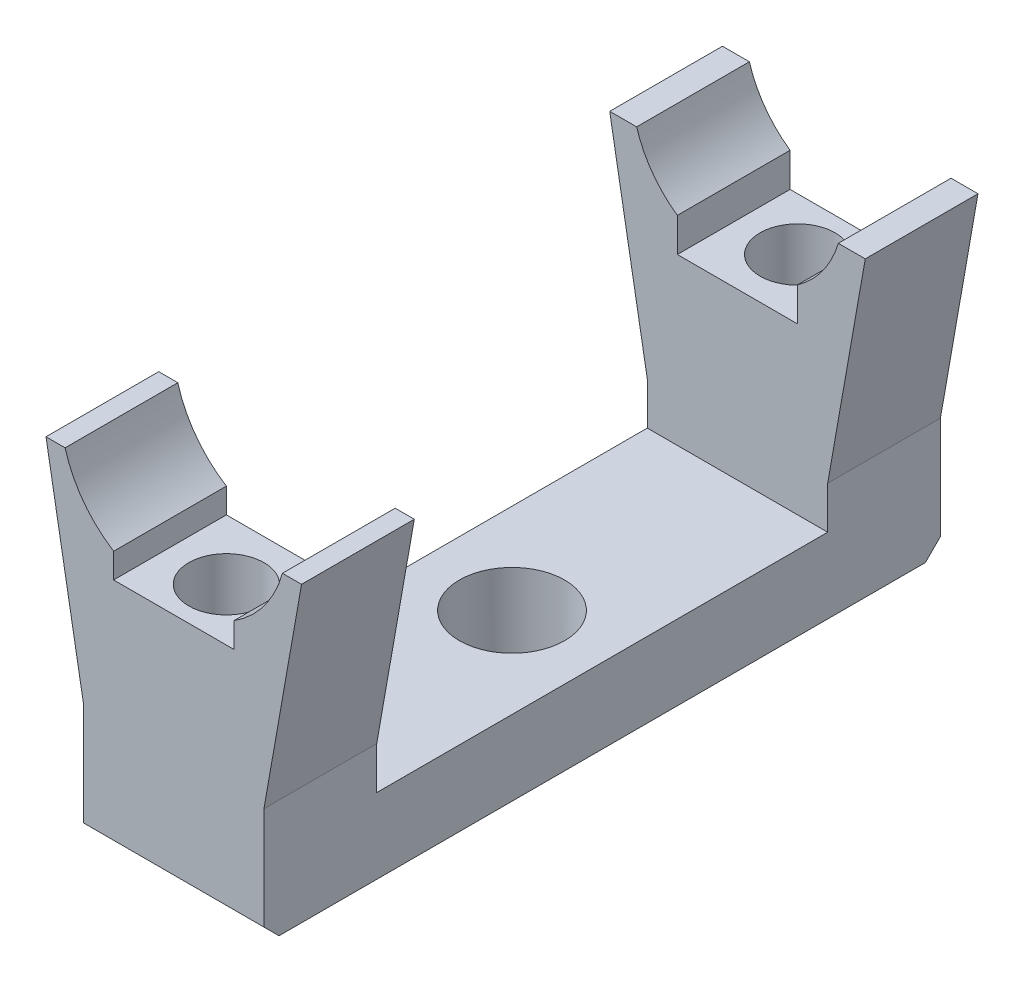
ISO-10303-21;
HEADER;
FILE_DESCRIPTION(('STEP AP214'),'2;1');
FILE_NAME('part.step','',(''),(''),'','','');
FILE_SCHEMA(('AUTOMOTIVE_DESIGN { 1 0 10303 214 1 1 1 1 }'));
ENDSEC;
DATA;
#1=APPLICATION_CONTEXT('core data for automotive mechanical design processes');
#2=APPLICATION_PROTOCOL_DEFINITION('international standard','automotive_design',2000,#1);
#3=PRODUCT_CONTEXT('',#1,'mechanical');
#4=PRODUCT('Part','Part','',(#3));
#5=PRODUCT_RELATED_PRODUCT_CATEGORY('part','',(#4));
#6=PRODUCT_DEFINITION_FORMATION('','',#4);
#7=PRODUCT_DEFINITION_CONTEXT('part definition',#1,'design');
#8=PRODUCT_DEFINITION('design','',#6,#7);
#9=PRODUCT_DEFINITION_SHAPE('','',#8);
#10=(LENGTH_UNIT() NAMED_UNIT(*) SI_UNIT(.MILLI.,.METRE.));
#11=(NAMED_UNIT(*) PLANE_ANGLE_UNIT() SI_UNIT($,.RADIAN.));
#12=(NAMED_UNIT(*) SI_UNIT($,.STERADIAN.) SOLID_ANGLE_UNIT());
#13=UNCERTAINTY_MEASURE_WITH_UNIT(LENGTH_MEASURE(1.E-05),#10,'distance_accuracy_value','');
#14=(GEOMETRIC_REPRESENTATION_CONTEXT(3) GLOBAL_UNCERTAINTY_ASSIGNED_CONTEXT((#13)) GLOBAL_UNIT_ASSIGNED_CONTEXT((#10,
#11,#12)) REPRESENTATION_CONTEXT('',''));
#15=CARTESIAN_POINT('',(0.,0.,0.));
#16=DIRECTION('',(0.,0.,1.));
#17=DIRECTION('',(1.,0.,0.));
#18=AXIS2_PLACEMENT_3D('',#15,#16,#17);
#19=CARTESIAN_POINT('',(-6.70820393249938,15.44475694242,22.5));
#20=DIRECTION('',(0.,-1.,0.));
#21=DIRECTION('',(0.,0.,-1.));
#22=AXIS2_PLACEMENT_3D('',#19,#20,#21);
#23=PLANE('',#22);
#24=DIRECTION('',(0.,0.,1.));
#25=VECTOR('',#24,1.);
#26=CARTESIAN_POINT('',(-7.22841614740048,15.44475694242,15.));
#27=LINE('',#26,#25);
#28=CARTESIAN_POINT('',(-7.22841614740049,15.44475694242,22.5));
#29=VERTEX_POINT('',#28);
#30=CARTESIAN_POINT('',(-7.22841614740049,15.44475694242,15.));
#31=VERTEX_POINT('',#30);
#32=EDGE_CURVE('E356',#29,#31,#27,.F.);
#33=ORIENTED_EDGE('',*,*,#32,.T.);
#34=DIRECTION('',(-1.,0.,0.));
#35=VECTOR('',#34,1.);
#36=CARTESIAN_POINT('',(-6.70820393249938,15.44475694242,15.));
#37=LINE('',#36,#35);
#38=CARTESIAN_POINT('',(-8.5,15.44475694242,15.));
#39=VERTEX_POINT('',#38);
#40=EDGE_CURVE('E254',#31,#39,#37,.T.);
#41=ORIENTED_EDGE('',*,*,#40,.T.);
#42=DIRECTION('',(0.,0.,-1.));
#43=VECTOR('',#42,1.);
#44=CARTESIAN_POINT('',(-8.5,15.44475694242,22.5));
#45=LINE('',#44,#43);
#46=CARTESIAN_POINT('',(-8.5,15.44475694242,22.5));
#47=VERTEX_POINT('',#46);
#48=EDGE_CURVE('E474',#47,#39,#45,.T.);
#49=ORIENTED_EDGE('',*,*,#48,.F.);
#50=DIRECTION('',(-1.,0.,0.));
#51=VECTOR('',#50,1.);
#52=CARTESIAN_POINT('',(-6.70820393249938,15.44475694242,22.5));
#53=LINE('',#52,#51);
#54=EDGE_CURVE('E361',#29,#47,#53,.T.);
#55=ORIENTED_EDGE('',*,*,#54,.F.);
#56=EDGE_LOOP('',(#33,#41,#49,#55));
#57=FACE_BOUND('',#56,.T.);
#58=ADVANCED_FACE('F43',(#57),#23,.F.);
#59=CARTESIAN_POINT('',(-8.5,15.44475694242,22.5));
#60=DIRECTION('',(0.984807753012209,0.173648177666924,0.));
#61=DIRECTION('',(-0.173648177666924,0.984807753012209,0.));
#62=AXIS2_PLACEMENT_3D('',#59,#60,#61);
#63=PLANE('',#62);
#64=ORIENTED_EDGE('',*,*,#48,.T.);
#65=DIRECTION('',(0.173648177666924,-0.984807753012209,0.));
#66=VECTOR('',#65,1.);
#67=CARTESIAN_POINT('',(-8.5,15.44475694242,15.));
#68=LINE('',#67,#66);
#69=CARTESIAN_POINT('',(-6.,1.26655239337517,15.));
#70=VERTEX_POINT('',#69);
#71=EDGE_CURVE('E267',#39,#70,#68,.T.);
#72=ORIENTED_EDGE('',*,*,#71,.T.);
#73=DIRECTION('',(0.,0.,-1.));
#74=VECTOR('',#73,1.);
#75=CARTESIAN_POINT('',(-6.,1.26655239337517,22.5));
#76=LINE('',#75,#74);
#77=CARTESIAN_POINT('',(-6.,1.26655239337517,22.5));
#78=VERTEX_POINT('',#77);
#79=EDGE_CURVE('E469',#78,#70,#76,.T.);
#80=ORIENTED_EDGE('',*,*,#79,.F.);
#81=DIRECTION('',(0.173648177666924,-0.984807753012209,0.));
#82=VECTOR('',#81,1.);
#83=CARTESIAN_POINT('',(-8.5,15.44475694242,22.5));
#84=LINE('',#83,#82);
#85=EDGE_CURVE('E364',#47,#78,#84,.T.);
#86=ORIENTED_EDGE('',*,*,#85,.F.);
#87=EDGE_LOOP('',(#64,#72,#80,#86));
#88=FACE_BOUND('',#87,.T.);
#89=ADVANCED_FACE('F580',(#88),#63,.F.);
#90=CARTESIAN_POINT('',(8.5,15.44475694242,22.5));
#91=DIRECTION('',(-0.984807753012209,0.173648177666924,0.));
#92=DIRECTION('',(-0.173648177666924,-0.984807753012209,0.));
#93=AXIS2_PLACEMENT_3D('',#90,#91,#92);
#94=PLANE('',#93);
#95=DIRECTION('',(0.,0.,-1.));
#96=VECTOR('',#95,1.);
#97=CARTESIAN_POINT('',(6.,1.26655239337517,22.5));
#98=LINE('',#97,#96);
#99=CARTESIAN_POINT('',(6.,1.26655239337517,22.5));
#100=VERTEX_POINT('',#99);
#101=CARTESIAN_POINT('',(6.,1.26655239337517,15.));
#102=VERTEX_POINT('',#101);
#103=EDGE_CURVE('E457',#100,#102,#98,.T.);
#104=ORIENTED_EDGE('',*,*,#103,.T.);
#105=DIRECTION('',(0.173648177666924,0.984807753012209,0.));
#106=VECTOR('',#105,1.);
#107=CARTESIAN_POINT('',(8.5,15.44475694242,15.));
#108=LINE('',#107,#106);
#109=CARTESIAN_POINT('',(8.5,15.44475694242,15.));
#110=VERTEX_POINT('',#109);
#111=EDGE_CURVE('E282',#102,#110,#108,.T.);
#112=ORIENTED_EDGE('',*,*,#111,.T.);
#113=DIRECTION('',(0.,0.,-1.));
#114=VECTOR('',#113,1.);
#115=CARTESIAN_POINT('',(8.5,15.44475694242,22.5));
#116=LINE('',#115,#114);
#117=CARTESIAN_POINT('',(8.5,15.44475694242,22.5));
#118=VERTEX_POINT('',#117);
#119=EDGE_CURVE('E452',#118,#110,#116,.T.);
#120=ORIENTED_EDGE('',*,*,#119,.F.);
#121=DIRECTION('',(0.173648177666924,0.984807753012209,0.));
#122=VECTOR('',#121,1.);
#123=CARTESIAN_POINT('',(8.5,15.44475694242,22.5));
#124=LINE('',#123,#122);
#125=EDGE_CURVE('E375',#100,#118,#124,.T.);
#126=ORIENTED_EDGE('',*,*,#125,.F.);
#127=EDGE_LOOP('',(#104,#112,#120,#126));
#128=FACE_BOUND('',#127,.T.);
#129=ADVANCED_FACE('F627',(#128),#94,.F.);
#130=CARTESIAN_POINT('',(6.70820393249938,15.44475694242,22.5));
#131=DIRECTION('',(0.,-1.,0.));
#132=DIRECTION('',(0.,0.,-1.));
#133=AXIS2_PLACEMENT_3D('',#130,#131,#132);
#134=PLANE('',#133);
#135=ORIENTED_EDGE('',*,*,#119,.T.);
#136=DIRECTION('',(-1.,0.,0.));
#137=VECTOR('',#136,1.);
#138=CARTESIAN_POINT('',(6.70820393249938,15.44475694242,15.));
#139=LINE('',#138,#137);
#140=CARTESIAN_POINT('',(7.22841614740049,15.44475694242,15.));
#141=VERTEX_POINT('',#140);
#142=EDGE_CURVE('E262',#110,#141,#139,.T.);
#143=ORIENTED_EDGE('',*,*,#142,.T.);
#144=DIRECTION('',(0.,0.,1.));
#145=VECTOR('',#144,1.);
#146=CARTESIAN_POINT('',(7.22841614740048,15.44475694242,15.));
#147=LINE('',#146,#145);
#148=CARTESIAN_POINT('',(7.22841614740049,15.44475694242,22.5));
#149=VERTEX_POINT('',#148);
#150=EDGE_CURVE('E352',#141,#149,#147,.T.);
#151=ORIENTED_EDGE('',*,*,#150,.T.);
#152=DIRECTION('',(-1.,0.,0.));
#153=VECTOR('',#152,1.);
#154=CARTESIAN_POINT('',(6.70820393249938,15.44475694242,22.5));
#155=LINE('',#154,#153);
#156=EDGE_CURVE('E378',#118,#149,#155,.T.);
#157=ORIENTED_EDGE('',*,*,#156,.F.);
#158=EDGE_LOOP('',(#135,#143,#151,#157));
#159=FACE_BOUND('',#158,.T.);
#160=ADVANCED_FACE('F555',(#159),#134,.F.);
#161=CARTESIAN_POINT('',(4.,11.700194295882,22.5));
#162=DIRECTION('',(1.,0.,0.));
#163=DIRECTION('',(0.,0.,-1.));
#164=AXIS2_PLACEMENT_3D('',#161,#162,#163);
#165=PLANE('',#164);
#166=DIRECTION('',(0.,0.,1.));
#167=VECTOR('',#166,1.);
#168=CARTESIAN_POINT('',(4.,11.1004681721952,15.));
#169=LINE('',#168,#167);
#170=CARTESIAN_POINT('',(4.,11.1004681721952,22.5));
#171=VERTEX_POINT('',#170);
#172=CARTESIAN_POINT('',(4.,11.1004681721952,15.));
#173=VERTEX_POINT('',#172);
#174=EDGE_CURVE('E348',#171,#173,#169,.F.);
#175=ORIENTED_EDGE('',*,*,#174,.T.);
#176=DIRECTION('',(0.,-1.,0.));
#177=VECTOR('',#176,1.);
#178=CARTESIAN_POINT('',(4.,11.700194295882,15.));
#179=LINE('',#178,#177);
#180=CARTESIAN_POINT('',(4.,9.44475694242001,15.));
#181=VERTEX_POINT('',#180);
#182=EDGE_CURVE('E275',#173,#181,#179,.T.);
#183=ORIENTED_EDGE('',*,*,#182,.T.);
#184=DIRECTION('',(0.,0.,-1.));
#185=VECTOR('',#184,1.);
#186=CARTESIAN_POINT('',(4.,9.44475694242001,22.5));
#187=LINE('',#186,#185);
#188=CARTESIAN_POINT('',(4.,9.44475694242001,22.5));
#189=VERTEX_POINT('',#188);
#190=EDGE_CURVE('E441',#189,#181,#187,.T.);
#191=ORIENTED_EDGE('',*,*,#190,.F.);
#192=DIRECTION('',(0.,-1.,0.));
#193=VECTOR('',#192,1.);
#194=CARTESIAN_POINT('',(4.,11.700194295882,22.5));
#195=LINE('',#194,#193);
#196=EDGE_CURVE('E382',#171,#189,#195,.T.);
#197=ORIENTED_EDGE('',*,*,#196,.F.);
#198=EDGE_LOOP('',(#175,#183,#191,#197));
#199=FACE_BOUND('',#198,.T.);
#200=ADVANCED_FACE('F563',(#199),#165,.F.);
#201=CARTESIAN_POINT('',(-4.,9.44475694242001,22.5));
#202=DIRECTION('',(0.,-1.,0.));
#203=DIRECTION('',(0.,0.,-1.));
#204=AXIS2_PLACEMENT_3D('',#201,#202,#203);
#205=PLANE('',#204);
#206=CARTESIAN_POINT('',(0.,9.44475694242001,19.));
#207=DIRECTION('',(0.,1.,0.));
#208=DIRECTION('',(0.,0.,1.));
#209=AXIS2_PLACEMENT_3D('',#206,#207,#208);
#210=CIRCLE('',#209,2.49999999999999);
#211=CARTESIAN_POINT('',(0.,9.44475694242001,21.5));
#212=VERTEX_POINT('',#211);
#213=EDGE_CURVE('E233',#212,#212,#210,.T.);
#214=ORIENTED_EDGE('',*,*,#213,.F.);
#215=EDGE_LOOP('',(#214));
#216=FACE_BOUND('',#215,.T.);
#217=ORIENTED_EDGE('',*,*,#190,.T.);
#218=DIRECTION('',(-1.,0.,0.));
#219=VECTOR('',#218,1.);
#220=CARTESIAN_POINT('',(-4.,9.44475694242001,15.));
#221=LINE('',#220,#219);
#222=CARTESIAN_POINT('',(-4.,9.44475694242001,15.));
#223=VERTEX_POINT('',#222);
#224=EDGE_CURVE('E263',#181,#223,#221,.T.);
#225=ORIENTED_EDGE('',*,*,#224,.T.);
#226=DIRECTION('',(0.,0.,-1.));
#227=VECTOR('',#226,1.);
#228=CARTESIAN_POINT('',(-4.,9.44475694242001,22.5));
#229=LINE('',#228,#227);
#230=CARTESIAN_POINT('',(-4.,9.44475694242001,22.5));
#231=VERTEX_POINT('',#230);
#232=EDGE_CURVE('E436',#231,#223,#229,.T.);
#233=ORIENTED_EDGE('',*,*,#232,.F.);
#234=DIRECTION('',(-1.,0.,0.));
#235=VECTOR('',#234,1.);
#236=CARTESIAN_POINT('',(-4.,9.44475694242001,22.5));
#237=LINE('',#236,#235);
#238=EDGE_CURVE('E385',#189,#231,#237,.T.);
#239=ORIENTED_EDGE('',*,*,#238,.F.);
#240=EDGE_LOOP('',(#217,#225,#233,#239));
#241=FACE_BOUND('',#240,.T.);
#242=ADVANCED_FACE('F567',(#216,#241),#205,.F.);
#243=CARTESIAN_POINT('',(-4.,11.700194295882,22.5));
#244=DIRECTION('',(-1.,0.,0.));
#245=DIRECTION('',(0.,0.,1.));
#246=AXIS2_PLACEMENT_3D('',#243,#244,#245);
#247=PLANE('',#246);
#248=ORIENTED_EDGE('',*,*,#232,.T.);
#249=DIRECTION('',(0.,1.,0.));
#250=VECTOR('',#249,1.);
#251=CARTESIAN_POINT('',(-4.,11.700194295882,15.));
#252=LINE('',#251,#250);
#253=CARTESIAN_POINT('',(-4.,11.1004681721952,15.));
#254=VERTEX_POINT('',#253);
#255=EDGE_CURVE('E258',#223,#254,#252,.T.);
#256=ORIENTED_EDGE('',*,*,#255,.T.);
#257=DIRECTION('',(0.,0.,1.));
#258=VECTOR('',#257,1.);
#259=CARTESIAN_POINT('',(-4.,11.1004681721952,15.));
#260=LINE('',#259,#258);
#261=CARTESIAN_POINT('',(-4.,11.1004681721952,22.5));
#262=VERTEX_POINT('',#261);
#263=EDGE_CURVE('E341',#254,#262,#260,.T.);
#264=ORIENTED_EDGE('',*,*,#263,.T.);
#265=DIRECTION('',(0.,1.,0.));
#266=VECTOR('',#265,1.);
#267=CARTESIAN_POINT('',(-4.,11.700194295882,22.5));
#268=LINE('',#267,#266);
#269=EDGE_CURVE('E388',#231,#262,#268,.T.);
#270=ORIENTED_EDGE('',*,*,#269,.F.);
#271=EDGE_LOOP('',(#248,#256,#264,#270));
#272=FACE_BOUND('',#271,.T.);
#273=ADVANCED_FACE('F572',(#272),#247,.F.);
#274=CARTESIAN_POINT('',(0.,17.44475694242,22.5));
#275=DIRECTION('',(0.,0.,-1.));
#276=DIRECTION('',(-1.,0.,0.));
#277=AXIS2_PLACEMENT_3D('',#274,#275,#276);
#278=CYLINDRICAL_SURFACE('',#277,7.);
#279=DIRECTION('',(0.,0.,-1.));
#280=VECTOR('',#279,1.);
#281=CARTESIAN_POINT('',(-6.70820393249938,15.44475694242,22.5));
#282=LINE('',#281,#280);
#283=CARTESIAN_POINT('',(-6.70820393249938,15.44475694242,-15.));
#284=VERTEX_POINT('',#283);
#285=CARTESIAN_POINT('',(-6.70820393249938,15.44475694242,-22.5));
#286=VERTEX_POINT('',#285);
#287=EDGE_CURVE('E478',#284,#286,#282,.T.);
#288=ORIENTED_EDGE('',*,*,#287,.F.);
#289=CARTESIAN_POINT('',(0.,17.44475694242,-15.));
#290=DIRECTION('',(0.,0.,-1.));
#291=DIRECTION('',(-1.,0.,0.));
#292=AXIS2_PLACEMENT_3D('',#289,#290,#291);
#293=CIRCLE('',#292,7.);
#294=CARTESIAN_POINT('',(-4.,11.700194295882,-15.));
#295=VERTEX_POINT('',#294);
#296=EDGE_CURVE('E305',#284,#295,#293,.F.);
#297=ORIENTED_EDGE('',*,*,#296,.T.);
#298=DIRECTION('',(0.,0.,-1.));
#299=VECTOR('',#298,1.);
#300=CARTESIAN_POINT('',(-4.,11.700194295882,22.5));
#301=LINE('',#300,#299);
#302=CARTESIAN_POINT('',(-4.,11.700194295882,-22.5));
#303=VERTEX_POINT('',#302);
#304=EDGE_CURVE('E392',#295,#303,#301,.T.);
#305=ORIENTED_EDGE('',*,*,#304,.T.);
#306=CARTESIAN_POINT('',(0.,17.44475694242,-22.5));
#307=DIRECTION('',(0.,0.,-1.));
#308=DIRECTION('',(1.,0.,0.));
#309=AXIS2_PLACEMENT_3D('',#306,#307,#308);
#310=CIRCLE('',#309,7.);
#311=EDGE_CURVE('E360',#303,#286,#310,.T.);
#312=ORIENTED_EDGE('',*,*,#311,.T.);
#313=EDGE_LOOP('',(#288,#297,#305,#312));
#314=FACE_BOUND('',#313,.T.);
#315=ADVANCED_FACE('F601',(#314),#278,.F.);
#316=CARTESIAN_POINT('',(0.,17.44475694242,22.5));
#317=DIRECTION('',(0.,0.,-1.));
#318=DIRECTION('',(-1.,0.,0.));
#319=AXIS2_PLACEMENT_3D('',#316,#317,#318);
#320=CYLINDRICAL_SURFACE('',#319,7.);
#321=DIRECTION('',(0.,0.,-1.));
#322=VECTOR('',#321,1.);
#323=CARTESIAN_POINT('',(4.,11.700194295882,22.5));
#324=LINE('',#323,#322);
#325=CARTESIAN_POINT('',(4.,11.700194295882,-15.));
#326=VERTEX_POINT('',#325);
#327=CARTESIAN_POINT('',(4.,11.700194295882,-22.5));
#328=VERTEX_POINT('',#327);
#329=EDGE_CURVE('E445',#326,#328,#324,.T.);
#330=ORIENTED_EDGE('',*,*,#329,.F.);
#331=CARTESIAN_POINT('',(0.,17.44475694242,-15.));
#332=DIRECTION('',(0.,0.,-1.));
#333=DIRECTION('',(-1.,0.,0.));
#334=AXIS2_PLACEMENT_3D('',#331,#332,#333);
#335=CIRCLE('',#334,7.);
#336=CARTESIAN_POINT('',(6.70820393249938,15.44475694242,-15.));
#337=VERTEX_POINT('',#336);
#338=EDGE_CURVE('E301',#326,#337,#335,.F.);
#339=ORIENTED_EDGE('',*,*,#338,.T.);
#340=DIRECTION('',(0.,0.,-1.));
#341=VECTOR('',#340,1.);
#342=CARTESIAN_POINT('',(6.70820393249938,15.44475694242,22.5));
#343=LINE('',#342,#341);
#344=CARTESIAN_POINT('',(6.70820393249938,15.44475694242,-22.5));
#345=VERTEX_POINT('',#344);
#346=EDGE_CURVE('E448',#337,#345,#343,.T.);
#347=ORIENTED_EDGE('',*,*,#346,.T.);
#348=CARTESIAN_POINT('',(0.,17.44475694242,-22.5));
#349=DIRECTION('',(0.,0.,-1.));
#350=DIRECTION('',(-1.,0.,0.));
#351=AXIS2_PLACEMENT_3D('',#348,#349,#350);
#352=CIRCLE('',#351,7.);
#353=EDGE_CURVE('E418',#345,#328,#352,.T.);
#354=ORIENTED_EDGE('',*,*,#353,.T.);
#355=EDGE_LOOP('',(#330,#339,#347,#354));
#356=FACE_BOUND('',#355,.T.);
#357=ADVANCED_FACE('F615',(#356),#320,.F.);
#358=CARTESIAN_POINT('',(-8.5,15.44475694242,-15.));
#359=VERTEX_POINT('',#358);
#360=CARTESIAN_POINT('',(-8.5,15.44475694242,-22.5));
#361=VERTEX_POINT('',#360);
#362=EDGE_CURVE('E473',#359,#361,#45,.T.);
#363=ORIENTED_EDGE('',*,*,#362,.F.);
#364=DIRECTION('',(1.,0.,0.));
#365=VECTOR('',#364,1.);
#366=CARTESIAN_POINT('',(-6.70820393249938,15.44475694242,-15.));
#367=LINE('',#366,#365);
#368=EDGE_CURVE('E321',#359,#284,#367,.T.);
#369=ORIENTED_EDGE('',*,*,#368,.T.);
#370=ORIENTED_EDGE('',*,*,#287,.T.);
#371=DIRECTION('',(-1.,0.,0.));
#372=VECTOR('',#371,1.);
#373=CARTESIAN_POINT('',(-6.70820393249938,15.44475694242,-22.5));
#374=LINE('',#373,#372);
#375=EDGE_CURVE('E396',#286,#361,#374,.T.);
#376=ORIENTED_EDGE('',*,*,#375,.T.);
#377=EDGE_LOOP('',(#363,#369,#370,#376));
#378=FACE_BOUND('',#377,.T.);
#379=ADVANCED_FACE('F596',(#378),#23,.F.);
#380=CARTESIAN_POINT('',(-6.,1.26655239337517,-15.));
#381=VERTEX_POINT('',#380);
#382=CARTESIAN_POINT('',(-6.,1.26655239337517,-22.5));
#383=VERTEX_POINT('',#382);
#384=EDGE_CURVE('E468',#381,#383,#76,.T.);
#385=ORIENTED_EDGE('',*,*,#384,.F.);
#386=DIRECTION('',(-0.173648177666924,0.984807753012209,0.));
#387=VECTOR('',#386,1.);
#388=CARTESIAN_POINT('',(-8.5,15.44475694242,-15.));
#389=LINE('',#388,#387);
#390=EDGE_CURVE('E325',#381,#359,#389,.T.);
#391=ORIENTED_EDGE('',*,*,#390,.T.);
#392=ORIENTED_EDGE('',*,*,#362,.T.);
#393=DIRECTION('',(0.173648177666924,-0.984807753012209,0.));
#394=VECTOR('',#393,1.);
#395=CARTESIAN_POINT('',(-8.5,15.44475694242,-22.5));
#396=LINE('',#395,#394);
#397=EDGE_CURVE('E400',#361,#383,#396,.T.);
#398=ORIENTED_EDGE('',*,*,#397,.T.);
#399=EDGE_LOOP('',(#385,#391,#392,#398));
#400=FACE_BOUND('',#399,.T.);
#401=ADVANCED_FACE('F589',(#400),#63,.F.);
#402=CARTESIAN_POINT('',(-6.,1.26655239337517,22.5));
#403=DIRECTION('',(1.,0.,0.));
#404=DIRECTION('',(0.,0.,-1.));
#405=AXIS2_PLACEMENT_3D('',#402,#403,#404);
#406=PLANE('',#405);
#407=DIRECTION('',(0.,0.,-1.));
#408=VECTOR('',#407,1.);
#409=CARTESIAN_POINT('',(-6.,-6.55524305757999,22.5));
#410=LINE('',#409,#408);
#411=CARTESIAN_POINT('',(-6.,-6.55524305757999,21.5));
#412=VERTEX_POINT('',#411);
#413=CARTESIAN_POINT('',(-6.,-6.55524305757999,-21.5));
#414=VERTEX_POINT('',#413);
#415=EDGE_CURVE('E465',#412,#414,#410,.T.);
#416=ORIENTED_EDGE('',*,*,#415,.F.);
#417=DIRECTION('',(0.,0.707106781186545,0.70710678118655));
#418=VECTOR('',#417,1.);
#419=CARTESIAN_POINT('',(-6.,-5.55524305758,22.5));
#420=LINE('',#419,#418);
#421=CARTESIAN_POINT('',(-6.,-5.55524305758,22.5));
#422=VERTEX_POINT('',#421);
#423=EDGE_CURVE('E52',#412,#422,#420,.T.);
#424=ORIENTED_EDGE('',*,*,#423,.T.);
#425=DIRECTION('',(0.,-1.,0.));
#426=VECTOR('',#425,1.);
#427=CARTESIAN_POINT('',(-6.,1.26655239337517,22.5));
#428=LINE('',#427,#426);
#429=EDGE_CURVE('E368',#78,#422,#428,.T.);
#430=ORIENTED_EDGE('',*,*,#429,.F.);
#431=ORIENTED_EDGE('',*,*,#79,.T.);
#432=DIRECTION('',(0.,-1.,0.));
#433=VECTOR('',#432,1.);
#434=CARTESIAN_POINT('',(-6.,1.26655239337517,15.));
#435=LINE('',#434,#433);
#436=CARTESIAN_POINT('',(-6.,-1.55524305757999,15.));
#437=VERTEX_POINT('',#436);
#438=EDGE_CURVE('E271',#70,#437,#435,.T.);
#439=ORIENTED_EDGE('',*,*,#438,.T.);
#440=DIRECTION('',(0.,0.,-1.));
#441=VECTOR('',#440,1.);
#442=CARTESIAN_POINT('',(-6.,-1.55524305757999,22.5));
#443=LINE('',#442,#441);
#444=CARTESIAN_POINT('',(-6.,-1.55524305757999,-15.));
#445=VERTEX_POINT('',#444);
#446=EDGE_CURVE('E333',#437,#445,#443,.T.);
#447=ORIENTED_EDGE('',*,*,#446,.T.);
#448=DIRECTION('',(0.,1.,0.));
#449=VECTOR('',#448,1.);
#450=CARTESIAN_POINT('',(-6.,1.26655239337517,-15.));
#451=LINE('',#450,#449);
#452=EDGE_CURVE('E329',#445,#381,#451,.T.);
#453=ORIENTED_EDGE('',*,*,#452,.T.);
#454=ORIENTED_EDGE('',*,*,#384,.T.);
#455=DIRECTION('',(0.,-1.,0.));
#456=VECTOR('',#455,1.);
#457=CARTESIAN_POINT('',(-6.,1.26655239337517,-22.5));
#458=LINE('',#457,#456);
#459=CARTESIAN_POINT('',(-6.,-5.55524305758,-22.5));
#460=VERTEX_POINT('',#459);
#461=EDGE_CURVE('E404',#383,#460,#458,.T.);
#462=ORIENTED_EDGE('',*,*,#461,.T.);
#463=DIRECTION('',(0.,0.707106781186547,-0.707106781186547));
#464=VECTOR('',#463,1.);
#465=CARTESIAN_POINT('',(-6.,-6.55524305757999,-21.5));
#466=LINE('',#465,#464);
#467=EDGE_CURVE('E64',#460,#414,#466,.F.);
#468=ORIENTED_EDGE('',*,*,#467,.T.);
#469=EDGE_LOOP('',(#416,#424,#430,#431,#439,#447,#453,#454,#462,#468));
#470=FACE_BOUND('',#469,.T.);
#471=ADVANCED_FACE('F517',(#470),#406,.F.);
#472=CARTESIAN_POINT('',(-6.,-6.55524305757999,22.5));
#473=DIRECTION('',(0.,1.,0.));
#474=DIRECTION('',(0.,0.,1.));
#475=AXIS2_PLACEMENT_3D('',#472,#473,#474);
#476=PLANE('',#475);
#477=CARTESIAN_POINT('',(0.,-6.55524305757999,0.));
#478=DIRECTION('',(0.,1.,0.));
#479=DIRECTION('',(0.,0.,1.));
#480=AXIS2_PLACEMENT_3D('',#477,#478,#479);
#481=CIRCLE('',#480,3.5);
#482=CARTESIAN_POINT('',(0.,-6.55524305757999,3.5));
#483=VERTEX_POINT('',#482);
#484=EDGE_CURVE('E496',#483,#483,#481,.T.);
#485=ORIENTED_EDGE('',*,*,#484,.T.);
#486=EDGE_LOOP('',(#485));
#487=FACE_BOUND('',#486,.T.);
#488=DIRECTION('',(0.,0.,-1.));
#489=VECTOR('',#488,1.);
#490=CARTESIAN_POINT('',(6.,-6.55524305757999,22.5));
#491=LINE('',#490,#489);
#492=CARTESIAN_POINT('',(6.,-6.55524305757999,21.5));
#493=VERTEX_POINT('',#492);
#494=CARTESIAN_POINT('',(6.,-6.55524305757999,-21.5));
#495=VERTEX_POINT('',#494);
#496=EDGE_CURVE('E461',#493,#495,#491,.T.);
#497=ORIENTED_EDGE('',*,*,#496,.F.);
#498=DIRECTION('',(-1.,0.,0.));
#499=VECTOR('',#498,1.);
#500=CARTESIAN_POINT('',(-6.,-6.55524305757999,21.5));
#501=LINE('',#500,#499);
#502=EDGE_CURVE('E510',#493,#412,#501,.T.);
#503=ORIENTED_EDGE('',*,*,#502,.T.);
#504=ORIENTED_EDGE('',*,*,#415,.T.);
#505=DIRECTION('',(1.,0.,0.));
#506=VECTOR('',#505,1.);
#507=CARTESIAN_POINT('',(-6.,-6.55524305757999,-21.5));
#508=LINE('',#507,#506);
#509=EDGE_CURVE('E506',#414,#495,#508,.T.);
#510=ORIENTED_EDGE('',*,*,#509,.T.);
#511=EDGE_LOOP('',(#497,#503,#504,#510));
#512=FACE_BOUND('',#511,.T.);
#513=ADVANCED_FACE('F532',(#487,#512),#476,.F.);
#514=CARTESIAN_POINT('',(6.,1.26655239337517,22.5));
#515=DIRECTION('',(-1.,0.,0.));
#516=DIRECTION('',(0.,0.,1.));
#517=AXIS2_PLACEMENT_3D('',#514,#515,#516);
#518=PLANE('',#517);
#519=DIRECTION('',(0.,1.,0.));
#520=VECTOR('',#519,1.);
#521=CARTESIAN_POINT('',(6.,1.26655239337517,22.5));
#522=LINE('',#521,#520);
#523=CARTESIAN_POINT('',(6.,-5.55524305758,22.5));
#524=VERTEX_POINT('',#523);
#525=EDGE_CURVE('E372',#524,#100,#522,.T.);
#526=ORIENTED_EDGE('',*,*,#525,.F.);
#527=DIRECTION('',(0.,-0.707106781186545,-0.70710678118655));
#528=VECTOR('',#527,1.);
#529=CARTESIAN_POINT('',(6.,-5.55524305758,22.5));
#530=LINE('',#529,#528);
#531=EDGE_CURVE('E503',#524,#493,#530,.T.);
#532=ORIENTED_EDGE('',*,*,#531,.T.);
#533=ORIENTED_EDGE('',*,*,#496,.T.);
#534=DIRECTION('',(0.,-0.707106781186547,0.707106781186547));
#535=VECTOR('',#534,1.);
#536=CARTESIAN_POINT('',(6.,-6.55524305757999,-21.5));
#537=LINE('',#536,#535);
#538=CARTESIAN_POINT('',(6.,-5.55524305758,-22.5));
#539=VERTEX_POINT('',#538);
#540=EDGE_CURVE('E500',#495,#539,#537,.F.);
#541=ORIENTED_EDGE('',*,*,#540,.T.);
#542=DIRECTION('',(0.,1.,0.));
#543=VECTOR('',#542,1.);
#544=CARTESIAN_POINT('',(6.,1.26655239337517,-22.5));
#545=LINE('',#544,#543);
#546=CARTESIAN_POINT('',(6.,1.26655239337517,-22.5));
#547=VERTEX_POINT('',#546);
#548=EDGE_CURVE('E407',#539,#547,#545,.T.);
#549=ORIENTED_EDGE('',*,*,#548,.T.);
#550=CARTESIAN_POINT('',(6.,1.26655239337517,-15.));
#551=VERTEX_POINT('',#550);
#552=EDGE_CURVE('E456',#551,#547,#98,.T.);
#553=ORIENTED_EDGE('',*,*,#552,.F.);
#554=DIRECTION('',(0.,-1.,0.));
#555=VECTOR('',#554,1.);
#556=CARTESIAN_POINT('',(6.,1.26655239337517,-15.));
#557=LINE('',#556,#555);
#558=CARTESIAN_POINT('',(6.,-1.55524305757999,-15.));
#559=VERTEX_POINT('',#558);
#560=EDGE_CURVE('E317',#551,#559,#557,.T.);
#561=ORIENTED_EDGE('',*,*,#560,.T.);
#562=DIRECTION('',(0.,0.,1.));
#563=VECTOR('',#562,1.);
#564=CARTESIAN_POINT('',(6.,-1.55524305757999,22.5));
#565=LINE('',#564,#563);
#566=CARTESIAN_POINT('',(6.,-1.55524305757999,15.));
#567=VERTEX_POINT('',#566);
#568=EDGE_CURVE('E488',#559,#567,#565,.T.);
#569=ORIENTED_EDGE('',*,*,#568,.T.);
#570=DIRECTION('',(0.,1.,0.));
#571=VECTOR('',#570,1.);
#572=CARTESIAN_POINT('',(6.,1.26655239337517,15.));
#573=LINE('',#572,#571);
#574=EDGE_CURVE('E289',#567,#102,#573,.T.);
#575=ORIENTED_EDGE('',*,*,#574,.T.);
#576=ORIENTED_EDGE('',*,*,#103,.F.);
#577=EDGE_LOOP('',(#526,#532,#533,#541,#549,#553,#561,#569,#575,#576));
#578=FACE_BOUND('',#577,.T.);
#579=ADVANCED_FACE('F529',(#578),#518,.F.);
#580=CARTESIAN_POINT('',(8.5,15.44475694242,-15.));
#581=VERTEX_POINT('',#580);
#582=CARTESIAN_POINT('',(8.5,15.44475694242,-22.5));
#583=VERTEX_POINT('',#582);
#584=EDGE_CURVE('E451',#581,#583,#116,.T.);
#585=ORIENTED_EDGE('',*,*,#584,.F.);
#586=DIRECTION('',(-0.173648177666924,-0.984807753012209,0.));
#587=VECTOR('',#586,1.);
#588=CARTESIAN_POINT('',(8.5,15.44475694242,-15.));
#589=LINE('',#588,#587);
#590=EDGE_CURVE('E313',#581,#551,#589,.T.);
#591=ORIENTED_EDGE('',*,*,#590,.T.);
#592=ORIENTED_EDGE('',*,*,#552,.T.);
#593=DIRECTION('',(0.173648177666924,0.984807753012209,0.));
#594=VECTOR('',#593,1.);
#595=CARTESIAN_POINT('',(8.5,15.44475694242,-22.5));
#596=LINE('',#595,#594);
#597=EDGE_CURVE('E410',#547,#583,#596,.T.);
#598=ORIENTED_EDGE('',*,*,#597,.T.);
#599=EDGE_LOOP('',(#585,#591,#592,#598));
#600=FACE_BOUND('',#599,.T.);
#601=ADVANCED_FACE('F543',(#600),#94,.F.);
#602=ORIENTED_EDGE('',*,*,#346,.F.);
#603=DIRECTION('',(1.,0.,0.));
#604=VECTOR('',#603,1.);
#605=CARTESIAN_POINT('',(6.70820393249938,15.44475694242,-15.));
#606=LINE('',#605,#604);
#607=EDGE_CURVE('E309',#337,#581,#606,.T.);
#608=ORIENTED_EDGE('',*,*,#607,.T.);
#609=ORIENTED_EDGE('',*,*,#584,.T.);
#610=DIRECTION('',(-1.,0.,0.));
#611=VECTOR('',#610,1.);
#612=CARTESIAN_POINT('',(6.70820393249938,15.44475694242,-22.5));
#613=LINE('',#612,#611);
#614=EDGE_CURVE('E414',#583,#345,#613,.T.);
#615=ORIENTED_EDGE('',*,*,#614,.T.);
#616=EDGE_LOOP('',(#602,#608,#609,#615));
#617=FACE_BOUND('',#616,.T.);
#618=ADVANCED_FACE('F618',(#617),#134,.F.);
#619=CARTESIAN_POINT('',(4.,9.44475694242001,-15.));
#620=VERTEX_POINT('',#619);
#621=CARTESIAN_POINT('',(4.,9.44475694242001,-22.5));
#622=VERTEX_POINT('',#621);
#623=EDGE_CURVE('E440',#620,#622,#187,.T.);
#624=ORIENTED_EDGE('',*,*,#623,.F.);
#625=DIRECTION('',(0.,1.,0.));
#626=VECTOR('',#625,1.);
#627=CARTESIAN_POINT('',(4.,11.700194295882,-15.));
#628=LINE('',#627,#626);
#629=EDGE_CURVE('E297',#620,#326,#628,.T.);
#630=ORIENTED_EDGE('',*,*,#629,.T.);
#631=ORIENTED_EDGE('',*,*,#329,.T.);
#632=DIRECTION('',(0.,-1.,0.));
#633=VECTOR('',#632,1.);
#634=CARTESIAN_POINT('',(4.,11.700194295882,-22.5));
#635=LINE('',#634,#633);
#636=EDGE_CURVE('E422',#328,#622,#635,.T.);
#637=ORIENTED_EDGE('',*,*,#636,.T.);
#638=EDGE_LOOP('',(#624,#630,#631,#637));
#639=FACE_BOUND('',#638,.T.);
#640=ADVANCED_FACE('F612',(#639),#165,.F.);
#641=CARTESIAN_POINT('',(0.,9.44475694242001,-19.));
#642=DIRECTION('',(0.,1.,0.));
#643=DIRECTION('',(0.,0.,1.));
#644=AXIS2_PLACEMENT_3D('',#641,#642,#643);
#645=CIRCLE('',#644,2.49999999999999);
#646=CARTESIAN_POINT('',(0.,9.44475694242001,-16.5));
#647=VERTEX_POINT('',#646);
#648=EDGE_CURVE('E234',#647,#647,#645,.T.);
#649=ORIENTED_EDGE('',*,*,#648,.F.);
#650=EDGE_LOOP('',(#649));
#651=FACE_BOUND('',#650,.T.);
#652=CARTESIAN_POINT('',(-4.,9.44475694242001,-15.));
#653=VERTEX_POINT('',#652);
#654=CARTESIAN_POINT('',(-4.,9.44475694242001,-22.5));
#655=VERTEX_POINT('',#654);
#656=EDGE_CURVE('E435',#653,#655,#229,.T.);
#657=ORIENTED_EDGE('',*,*,#656,.F.);
#658=DIRECTION('',(1.,0.,0.));
#659=VECTOR('',#658,1.);
#660=CARTESIAN_POINT('',(-4.,9.44475694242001,-15.));
#661=LINE('',#660,#659);
#662=EDGE_CURVE('E293',#653,#620,#661,.T.);
#663=ORIENTED_EDGE('',*,*,#662,.T.);
#664=ORIENTED_EDGE('',*,*,#623,.T.);
#665=DIRECTION('',(-1.,0.,0.));
#666=VECTOR('',#665,1.);
#667=CARTESIAN_POINT('',(-4.,9.44475694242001,-22.5));
#668=LINE('',#667,#666);
#669=EDGE_CURVE('E426',#622,#655,#668,.T.);
#670=ORIENTED_EDGE('',*,*,#669,.T.);
#671=EDGE_LOOP('',(#657,#663,#664,#670));
#672=FACE_BOUND('',#671,.T.);
#673=ADVANCED_FACE('F609',(#651,#672),#205,.F.);
#674=ORIENTED_EDGE('',*,*,#304,.F.);
#675=DIRECTION('',(0.,-1.,0.));
#676=VECTOR('',#675,1.);
#677=CARTESIAN_POINT('',(-4.,11.700194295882,-15.));
#678=LINE('',#677,#676);
#679=EDGE_CURVE('E484',#295,#653,#678,.T.);
#680=ORIENTED_EDGE('',*,*,#679,.T.);
#681=ORIENTED_EDGE('',*,*,#656,.T.);
#682=DIRECTION('',(0.,1.,0.));
#683=VECTOR('',#682,1.);
#684=CARTESIAN_POINT('',(-4.,11.700194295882,-22.5));
#685=LINE('',#684,#683);
#686=EDGE_CURVE('E365',#655,#303,#685,.T.);
#687=ORIENTED_EDGE('',*,*,#686,.T.);
#688=EDGE_LOOP('',(#674,#680,#681,#687));
#689=FACE_BOUND('',#688,.T.);
#690=ADVANCED_FACE('F604',(#689),#247,.F.);
#691=CARTESIAN_POINT('',(0.,17.44475694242,22.5));
#692=DIRECTION('',(0.,0.,1.));
#693=DIRECTION('',(1.,0.,0.));
#694=AXIS2_PLACEMENT_3D('',#691,#692,#693);
#695=PLANE('',#694);
#696=ORIENTED_EDGE('',*,*,#429,.T.);
#697=DIRECTION('',(1.,0.,0.));
#698=VECTOR('',#697,1.);
#699=CARTESIAN_POINT('',(6.,-5.55524305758,22.5));
#700=LINE('',#699,#698);
#701=EDGE_CURVE('E492',#422,#524,#700,.T.);
#702=ORIENTED_EDGE('',*,*,#701,.T.);
#703=ORIENTED_EDGE('',*,*,#525,.T.);
#704=ORIENTED_EDGE('',*,*,#125,.T.);
#705=ORIENTED_EDGE('',*,*,#156,.T.);
#706=CARTESIAN_POINT('',(0.,17.44475694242,22.5));
#707=DIRECTION('',(0.,0.,1.));
#708=DIRECTION('',(1.,0.,0.));
#709=AXIS2_PLACEMENT_3D('',#706,#707,#708);
#710=CIRCLE('',#709,7.5);
#711=EDGE_CURVE('E481',#171,#149,#710,.T.);
#712=ORIENTED_EDGE('',*,*,#711,.F.);
#713=ORIENTED_EDGE('',*,*,#196,.T.);
#714=ORIENTED_EDGE('',*,*,#238,.T.);
#715=ORIENTED_EDGE('',*,*,#269,.T.);
#716=CARTESIAN_POINT('',(0.,17.44475694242,22.5));
#717=DIRECTION('',(0.,0.,1.));
#718=DIRECTION('',(1.,0.,0.));
#719=AXIS2_PLACEMENT_3D('',#716,#717,#718);
#720=CIRCLE('',#719,7.5);
#721=EDGE_CURVE('E337',#29,#262,#720,.T.);
#722=ORIENTED_EDGE('',*,*,#721,.F.);
#723=ORIENTED_EDGE('',*,*,#54,.T.);
#724=ORIENTED_EDGE('',*,*,#85,.T.);
#725=EDGE_LOOP('',(#696,#702,#703,#704,#705,#712,#713,#714,#715,#722,#723,#724));
#726=FACE_BOUND('',#725,.T.);
#727=ADVANCED_FACE('F522',(#726),#695,.T.);
#728=CARTESIAN_POINT('',(0.,17.44475694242,-22.5));
#729=DIRECTION('',(0.,0.,1.));
#730=DIRECTION('',(1.,0.,0.));
#731=AXIS2_PLACEMENT_3D('',#728,#729,#730);
#732=PLANE('',#731);
#733=ORIENTED_EDGE('',*,*,#548,.F.);
#734=DIRECTION('',(-1.,0.,0.));
#735=VECTOR('',#734,1.);
#736=CARTESIAN_POINT('',(0.,-5.55524305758,-22.5));
#737=LINE('',#736,#735);
#738=EDGE_CURVE('E11',#539,#460,#737,.T.);
#739=ORIENTED_EDGE('',*,*,#738,.T.);
#740=ORIENTED_EDGE('',*,*,#461,.F.);
#741=ORIENTED_EDGE('',*,*,#397,.F.);
#742=ORIENTED_EDGE('',*,*,#375,.F.);
#743=ORIENTED_EDGE('',*,*,#311,.F.);
#744=ORIENTED_EDGE('',*,*,#686,.F.);
#745=ORIENTED_EDGE('',*,*,#669,.F.);
#746=ORIENTED_EDGE('',*,*,#636,.F.);
#747=ORIENTED_EDGE('',*,*,#353,.F.);
#748=ORIENTED_EDGE('',*,*,#614,.F.);
#749=ORIENTED_EDGE('',*,*,#597,.F.);
#750=EDGE_LOOP('',(#733,#739,#740,#741,#742,#743,#744,#745,#746,#747,#748,#749));
#751=FACE_BOUND('',#750,.T.);
#752=ADVANCED_FACE('F538',(#751),#732,.F.);
#753=CARTESIAN_POINT('',(0.,17.44475694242,15.));
#754=DIRECTION('',(0.,0.,1.));
#755=DIRECTION('',(1.,0.,0.));
#756=AXIS2_PLACEMENT_3D('',#753,#754,#755);
#757=CYLINDRICAL_SURFACE('',#756,7.5);
#758=CARTESIAN_POINT('',(0.,17.44475694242,15.));
#759=DIRECTION('',(0.,0.,1.));
#760=DIRECTION('',(1.,0.,0.));
#761=AXIS2_PLACEMENT_3D('',#758,#759,#760);
#762=CIRCLE('',#761,7.5);
#763=EDGE_CURVE('E342',#173,#141,#762,.T.);
#764=ORIENTED_EDGE('',*,*,#763,.F.);
#765=ORIENTED_EDGE('',*,*,#174,.F.);
#766=ORIENTED_EDGE('',*,*,#711,.T.);
#767=ORIENTED_EDGE('',*,*,#150,.F.);
#768=EDGE_LOOP('',(#764,#765,#766,#767));
#769=FACE_BOUND('',#768,.T.);
#770=ADVANCED_FACE('F558',(#769),#757,.F.);
#771=ORIENTED_EDGE('',*,*,#721,.T.);
#772=ORIENTED_EDGE('',*,*,#263,.F.);
#773=EDGE_CURVE('E338',#31,#254,#762,.T.);
#774=ORIENTED_EDGE('',*,*,#773,.F.);
#775=ORIENTED_EDGE('',*,*,#32,.F.);
#776=EDGE_LOOP('',(#771,#772,#774,#775));
#777=FACE_BOUND('',#776,.T.);
#778=ADVANCED_FACE('F576',(#777),#757,.F.);
#779=CARTESIAN_POINT('',(8.5,-1.55524305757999,-15.));
#780=DIRECTION('',(0.,-1.,0.));
#781=DIRECTION('',(0.,0.,-1.));
#782=AXIS2_PLACEMENT_3D('',#779,#780,#781);
#783=PLANE('',#782);
#784=CARTESIAN_POINT('',(0.,-1.55524305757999,0.));
#785=DIRECTION('',(0.,-1.,0.));
#786=DIRECTION('',(0.,0.,-1.));
#787=AXIS2_PLACEMENT_3D('',#784,#785,#786);
#788=CIRCLE('',#787,3.5);
#789=CARTESIAN_POINT('',(0.,-1.55524305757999,-3.5));
#790=VERTEX_POINT('',#789);
#791=EDGE_CURVE('E242',#790,#790,#788,.T.);
#792=ORIENTED_EDGE('',*,*,#791,.T.);
#793=EDGE_LOOP('',(#792));
#794=FACE_BOUND('',#793,.T.);
#795=DIRECTION('',(-1.,0.,0.));
#796=VECTOR('',#795,1.);
#797=CARTESIAN_POINT('',(8.5,-1.55524305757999,15.));
#798=LINE('',#797,#796);
#799=EDGE_CURVE('E250',#567,#437,#798,.T.);
#800=ORIENTED_EDGE('',*,*,#799,.F.);
#801=ORIENTED_EDGE('',*,*,#568,.F.);
#802=DIRECTION('',(-1.,0.,0.));
#803=VECTOR('',#802,1.);
#804=CARTESIAN_POINT('',(8.5,-1.55524305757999,-15.));
#805=LINE('',#804,#803);
#806=EDGE_CURVE('E249',#559,#445,#805,.T.);
#807=ORIENTED_EDGE('',*,*,#806,.T.);
#808=ORIENTED_EDGE('',*,*,#446,.F.);
#809=EDGE_LOOP('',(#800,#801,#807,#808));
#810=FACE_BOUND('',#809,.T.);
#811=ADVANCED_FACE('F583',(#794,#810),#783,.F.);
#812=CARTESIAN_POINT('',(8.5,-1.55524305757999,-15.));
#813=DIRECTION('',(0.,0.,-1.));
#814=DIRECTION('',(-1.,0.,0.));
#815=AXIS2_PLACEMENT_3D('',#812,#813,#814);
#816=PLANE('',#815);
#817=ORIENTED_EDGE('',*,*,#806,.F.);
#818=ORIENTED_EDGE('',*,*,#560,.F.);
#819=ORIENTED_EDGE('',*,*,#590,.F.);
#820=ORIENTED_EDGE('',*,*,#607,.F.);
#821=ORIENTED_EDGE('',*,*,#338,.F.);
#822=ORIENTED_EDGE('',*,*,#629,.F.);
#823=ORIENTED_EDGE('',*,*,#662,.F.);
#824=ORIENTED_EDGE('',*,*,#679,.F.);
#825=ORIENTED_EDGE('',*,*,#296,.F.);
#826=ORIENTED_EDGE('',*,*,#368,.F.);
#827=ORIENTED_EDGE('',*,*,#390,.F.);
#828=ORIENTED_EDGE('',*,*,#452,.F.);
#829=EDGE_LOOP('',(#817,#818,#819,#820,#821,#822,#823,#824,#825,#826,#827,#828));
#830=FACE_BOUND('',#829,.T.);
#831=ADVANCED_FACE('F586',(#830),#816,.F.);
#832=CARTESIAN_POINT('',(8.5,-1.55524305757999,15.));
#833=DIRECTION('',(0.,0.,1.));
#834=DIRECTION('',(0.,-1.,0.));
#835=AXIS2_PLACEMENT_3D('',#832,#833,#834);
#836=PLANE('',#835);
#837=ORIENTED_EDGE('',*,*,#799,.T.);
#838=ORIENTED_EDGE('',*,*,#438,.F.);
#839=ORIENTED_EDGE('',*,*,#71,.F.);
#840=ORIENTED_EDGE('',*,*,#40,.F.);
#841=ORIENTED_EDGE('',*,*,#773,.T.);
#842=ORIENTED_EDGE('',*,*,#255,.F.);
#843=ORIENTED_EDGE('',*,*,#224,.F.);
#844=ORIENTED_EDGE('',*,*,#182,.F.);
#845=ORIENTED_EDGE('',*,*,#763,.T.);
#846=ORIENTED_EDGE('',*,*,#142,.F.);
#847=ORIENTED_EDGE('',*,*,#111,.F.);
#848=ORIENTED_EDGE('',*,*,#574,.F.);
#849=EDGE_LOOP('',(#837,#838,#839,#840,#841,#842,#843,#844,#845,#846,#847,#848));
#850=FACE_BOUND('',#849,.T.);
#851=ADVANCED_FACE('F551',(#850),#836,.F.);
#852=CARTESIAN_POINT('',(0.,-2.55524305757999,19.));
#853=DIRECTION('',(0.,1.,0.));
#854=DIRECTION('',(0.,0.,1.));
#855=AXIS2_PLACEMENT_3D('',#852,#853,#854);
#856=CONICAL_SURFACE('',#855,2.5,1.02974425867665);
#857=CARTESIAN_POINT('',(0.,-4.05739460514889,19.));
#858=VERTEX_POINT('',#857);
#859=VERTEX_LOOP('',#858);
#860=FACE_BOUND('',#859,.T.);
#861=CARTESIAN_POINT('',(0.,-2.55524305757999,19.));
#862=DIRECTION('',(0.,1.,0.));
#863=DIRECTION('',(0.,0.,1.));
#864=AXIS2_PLACEMENT_3D('',#861,#862,#863);
#865=CIRCLE('',#864,2.5);
#866=CARTESIAN_POINT('',(0.,-2.55524305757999,21.5));
#867=VERTEX_POINT('',#866);
#868=EDGE_CURVE('E239',#867,#867,#865,.T.);
#869=ORIENTED_EDGE('',*,*,#868,.T.);
#870=EDGE_LOOP('',(#869));
#871=FACE_BOUND('',#870,.T.);
#872=ADVANCED_FACE('F659',(#860,#871),#856,.F.);
#873=CARTESIAN_POINT('',(0.,9.44475694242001,19.));
#874=DIRECTION('',(0.,1.,0.));
#875=DIRECTION('',(0.,0.,1.));
#876=AXIS2_PLACEMENT_3D('',#873,#874,#875);
#877=CYLINDRICAL_SURFACE('',#876,2.49999999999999);
#878=ORIENTED_EDGE('',*,*,#868,.F.);
#879=EDGE_LOOP('',(#878));
#880=FACE_BOUND('',#879,.T.);
#881=ORIENTED_EDGE('',*,*,#213,.T.);
#882=EDGE_LOOP('',(#881));
#883=FACE_BOUND('',#882,.T.);
#884=ADVANCED_FACE('F226',(#880,#883),#877,.F.);
#885=CARTESIAN_POINT('',(0.,-2.55524305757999,-19.));
#886=DIRECTION('',(0.,1.,0.));
#887=DIRECTION('',(0.,0.,1.));
#888=AXIS2_PLACEMENT_3D('',#885,#886,#887);
#889=CONICAL_SURFACE('',#888,2.5,1.02974425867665);
#890=CARTESIAN_POINT('',(0.,-4.05739460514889,-19.));
#891=VERTEX_POINT('',#890);
#892=VERTEX_LOOP('',#891);
#893=FACE_BOUND('',#892,.T.);
#894=CARTESIAN_POINT('',(0.,-2.55524305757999,-19.));
#895=DIRECTION('',(0.,1.,0.));
#896=DIRECTION('',(0.,0.,1.));
#897=AXIS2_PLACEMENT_3D('',#894,#895,#896);
#898=CIRCLE('',#897,2.5);
#899=CARTESIAN_POINT('',(0.,-2.55524305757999,-16.5));
#900=VERTEX_POINT('',#899);
#901=EDGE_CURVE('E230',#900,#900,#898,.T.);
#902=ORIENTED_EDGE('',*,*,#901,.T.);
#903=EDGE_LOOP('',(#902));
#904=FACE_BOUND('',#903,.T.);
#905=ADVANCED_FACE('F222',(#893,#904),#889,.F.);
#906=CARTESIAN_POINT('',(0.,9.44475694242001,-19.));
#907=DIRECTION('',(0.,1.,0.));
#908=DIRECTION('',(0.,0.,1.));
#909=AXIS2_PLACEMENT_3D('',#906,#907,#908);
#910=CYLINDRICAL_SURFACE('',#909,2.49999999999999);
#911=ORIENTED_EDGE('',*,*,#901,.F.);
#912=EDGE_LOOP('',(#911));
#913=FACE_BOUND('',#912,.T.);
#914=ORIENTED_EDGE('',*,*,#648,.T.);
#915=EDGE_LOOP('',(#914));
#916=FACE_BOUND('',#915,.T.);
#917=ADVANCED_FACE('F225',(#913,#916),#910,.F.);
#918=CARTESIAN_POINT('',(0.,-6.55524305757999,0.));
#919=DIRECTION('',(0.,1.,0.));
#920=DIRECTION('',(0.,0.,1.));
#921=AXIS2_PLACEMENT_3D('',#918,#919,#920);
#922=CYLINDRICAL_SURFACE('',#921,3.5);
#923=ORIENTED_EDGE('',*,*,#484,.F.);
#924=EDGE_LOOP('',(#923));
#925=FACE_BOUND('',#924,.T.);
#926=ORIENTED_EDGE('',*,*,#791,.F.);
#927=EDGE_LOOP('',(#926));
#928=FACE_BOUND('',#927,.T.);
#929=ADVANCED_FACE('F673',(#925,#928),#922,.F.);
#930=CARTESIAN_POINT('',(0.,-5.55524305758,22.5));
#931=DIRECTION('',(0.,-0.70710678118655,0.707106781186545));
#932=DIRECTION('',(-1.,0.,0.));
#933=AXIS2_PLACEMENT_3D('',#930,#931,#932);
#934=PLANE('',#933);
#935=ORIENTED_EDGE('',*,*,#423,.F.);
#936=ORIENTED_EDGE('',*,*,#502,.F.);
#937=ORIENTED_EDGE('',*,*,#531,.F.);
#938=ORIENTED_EDGE('',*,*,#701,.F.);
#939=EDGE_LOOP('',(#935,#936,#937,#938));
#940=FACE_BOUND('',#939,.T.);
#941=ADVANCED_FACE('F526',(#940),#934,.T.);
#942=CARTESIAN_POINT('',(-6.,-6.55524305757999,-21.5));
#943=DIRECTION('',(0.,0.707106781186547,0.707106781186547));
#944=DIRECTION('',(1.,0.,0.));
#945=AXIS2_PLACEMENT_3D('',#942,#943,#944);
#946=PLANE('',#945);
#947=ORIENTED_EDGE('',*,*,#467,.F.);
#948=ORIENTED_EDGE('',*,*,#738,.F.);
#949=ORIENTED_EDGE('',*,*,#540,.F.);
#950=ORIENTED_EDGE('',*,*,#509,.F.);
#951=EDGE_LOOP('',(#947,#948,#949,#950));
#952=FACE_BOUND('',#951,.T.);
#953=ADVANCED_FACE('F45',(#952),#946,.F.);
#954=CLOSED_SHELL('',(#58,#89,#129,#160,#200,#242,#273,#315,#357,#379,#401,#471,#513,#579,#601,
#618,#640,#673,#690,#727,#752,#770,#778,#811,#831,#851,#872,#884,#905,#917,#929,#941,#953));
#955=MANIFOLD_SOLID_BREP('B2',#954);
#956=ADVANCED_BREP_SHAPE_REPRESENTATION('',(#18,#955),#14);
#957=SHAPE_DEFINITION_REPRESENTATION(#9,#956);
ENDSEC;
END-ISO-10303-21;
